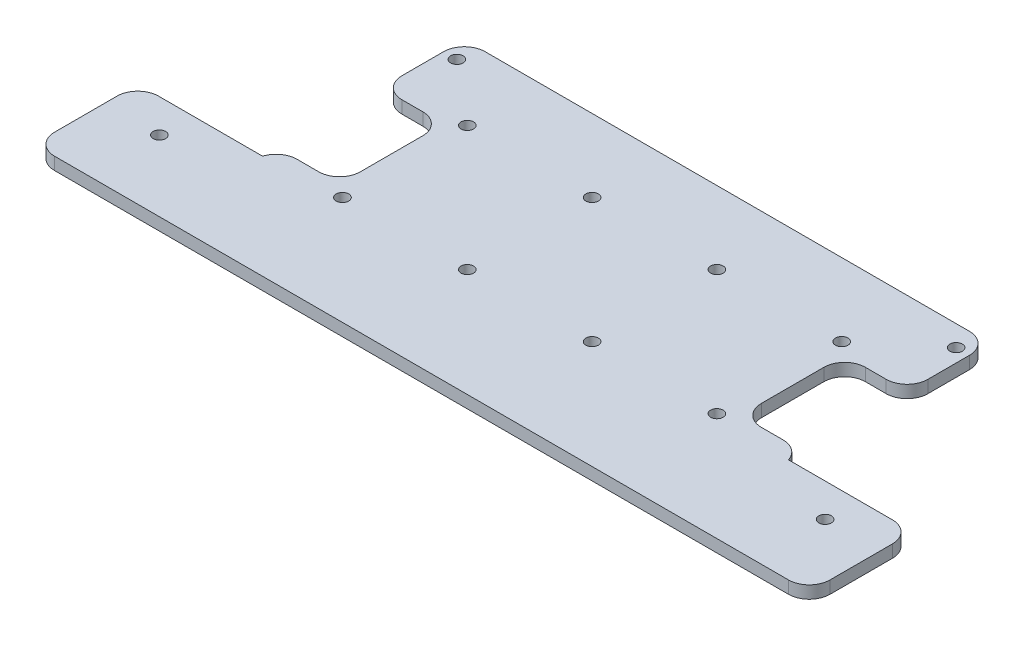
ISO-10303-21;
HEADER;
FILE_DESCRIPTION(('STEP AP214'),'2;1');
FILE_NAME('part.step','',(''),(''),'','','');
FILE_SCHEMA(('AUTOMOTIVE_DESIGN { 1 0 10303 214 1 1 1 1 }'));
ENDSEC;
DATA;
#1=APPLICATION_CONTEXT('core data for automotive mechanical design processes');
#2=APPLICATION_PROTOCOL_DEFINITION('international standard','automotive_design',2000,#1);
#3=PRODUCT_CONTEXT('',#1,'mechanical');
#4=PRODUCT('Part','Part','',(#3));
#5=PRODUCT_RELATED_PRODUCT_CATEGORY('part','',(#4));
#6=PRODUCT_DEFINITION_FORMATION('','',#4);
#7=PRODUCT_DEFINITION_CONTEXT('part definition',#1,'design');
#8=PRODUCT_DEFINITION('design','',#6,#7);
#9=PRODUCT_DEFINITION_SHAPE('','',#8);
#10=(LENGTH_UNIT() NAMED_UNIT(*) SI_UNIT(.MILLI.,.METRE.));
#11=(NAMED_UNIT(*) PLANE_ANGLE_UNIT() SI_UNIT($,.RADIAN.));
#12=(NAMED_UNIT(*) SI_UNIT($,.STERADIAN.) SOLID_ANGLE_UNIT());
#13=UNCERTAINTY_MEASURE_WITH_UNIT(LENGTH_MEASURE(1.E-05),#10,'distance_accuracy_value','');
#14=(GEOMETRIC_REPRESENTATION_CONTEXT(3) GLOBAL_UNCERTAINTY_ASSIGNED_CONTEXT((#13)) GLOBAL_UNIT_ASSIGNED_CONTEXT((#10,
#11,#12)) REPRESENTATION_CONTEXT('',''));
#15=CARTESIAN_POINT('',(0.,0.,0.));
#16=DIRECTION('',(0.,0.,1.));
#17=DIRECTION('',(1.,0.,0.));
#18=AXIS2_PLACEMENT_3D('',#15,#16,#17);
#19=CARTESIAN_POINT('',(63.2,0.,-36.75));
#20=DIRECTION('',(1.,0.,0.));
#21=DIRECTION('',(0.,0.,-1.));
#22=AXIS2_PLACEMENT_3D('',#19,#20,#21);
#23=PLANE('',#22);
#24=DIRECTION('',(0.,0.,-1.));
#25=VECTOR('',#24,1.);
#26=CARTESIAN_POINT('',(63.2,3.,-36.75));
#27=LINE('',#26,#25);
#28=CARTESIAN_POINT('',(63.2,3.,-21.75));
#29=VERTEX_POINT('',#28);
#30=CARTESIAN_POINT('',(63.2,3.,-31.75));
#31=VERTEX_POINT('',#30);
#32=EDGE_CURVE('E261',#29,#31,#27,.T.);
#33=ORIENTED_EDGE('',*,*,#32,.F.);
#34=DIRECTION('',(0.,1.,0.));
#35=VECTOR('',#34,1.);
#36=CARTESIAN_POINT('',(63.2,0.,-21.75));
#37=LINE('',#36,#35);
#38=CARTESIAN_POINT('',(63.2,0.,-21.75));
#39=VERTEX_POINT('',#38);
#40=EDGE_CURVE('E370',#29,#39,#37,.F.);
#41=ORIENTED_EDGE('',*,*,#40,.T.);
#42=DIRECTION('',(0.,0.,-1.));
#43=VECTOR('',#42,1.);
#44=CARTESIAN_POINT('',(63.2,0.,-36.75));
#45=LINE('',#44,#43);
#46=CARTESIAN_POINT('',(63.2,0.,-31.75));
#47=VERTEX_POINT('',#46);
#48=EDGE_CURVE('E247',#39,#47,#45,.T.);
#49=ORIENTED_EDGE('',*,*,#48,.T.);
#50=DIRECTION('',(0.,1.,0.));
#51=VECTOR('',#50,1.);
#52=CARTESIAN_POINT('',(63.2,3.,-31.75));
#53=LINE('',#52,#51);
#54=EDGE_CURVE('E367',#47,#31,#53,.T.);
#55=ORIENTED_EDGE('',*,*,#54,.T.);
#56=EDGE_LOOP('',(#33,#41,#49,#55));
#57=FACE_BOUND('',#56,.T.);
#58=ADVANCED_FACE('F36',(#57),#23,.T.);
#59=CARTESIAN_POINT('',(-63.2,0.,-36.75));
#60=DIRECTION('',(-1.,0.,0.));
#61=DIRECTION('',(0.,0.,1.));
#62=AXIS2_PLACEMENT_3D('',#59,#60,#61);
#63=PLANE('',#62);
#64=DIRECTION('',(0.,0.,1.));
#65=VECTOR('',#64,1.);
#66=CARTESIAN_POINT('',(-63.2,3.,-36.75));
#67=LINE('',#66,#65);
#68=CARTESIAN_POINT('',(-63.2,3.,-31.75));
#69=VERTEX_POINT('',#68);
#70=CARTESIAN_POINT('',(-63.2,3.,-21.75));
#71=VERTEX_POINT('',#70);
#72=EDGE_CURVE('E269',#69,#71,#67,.T.);
#73=ORIENTED_EDGE('',*,*,#72,.F.);
#74=DIRECTION('',(0.,1.,0.));
#75=VECTOR('',#74,1.);
#76=CARTESIAN_POINT('',(-63.2,0.,-31.75));
#77=LINE('',#76,#75);
#78=CARTESIAN_POINT('',(-63.2,0.,-31.75));
#79=VERTEX_POINT('',#78);
#80=EDGE_CURVE('E388',#69,#79,#77,.F.);
#81=ORIENTED_EDGE('',*,*,#80,.T.);
#82=DIRECTION('',(0.,0.,1.));
#83=VECTOR('',#82,1.);
#84=CARTESIAN_POINT('',(-63.2,0.,-36.75));
#85=LINE('',#84,#83);
#86=CARTESIAN_POINT('',(-63.2,0.,-21.75));
#87=VERTEX_POINT('',#86);
#88=EDGE_CURVE('E272',#79,#87,#85,.T.);
#89=ORIENTED_EDGE('',*,*,#88,.T.);
#90=DIRECTION('',(0.,-1.,0.));
#91=VECTOR('',#90,1.);
#92=CARTESIAN_POINT('',(-63.2,3.,-21.75));
#93=LINE('',#92,#91);
#94=EDGE_CURVE('E386',#87,#71,#93,.F.);
#95=ORIENTED_EDGE('',*,*,#94,.T.);
#96=EDGE_LOOP('',(#73,#81,#89,#95));
#97=FACE_BOUND('',#96,.T.);
#98=ADVANCED_FACE('F545',(#97),#63,.T.);
#99=CARTESIAN_POINT('',(-53.2,3.,-36.75));
#100=DIRECTION('',(0.,0.,1.));
#101=DIRECTION('',(1.,0.,0.));
#102=AXIS2_PLACEMENT_3D('',#99,#100,#101);
#103=PLANE('',#102);
#104=DIRECTION('',(-1.,0.,0.));
#105=VECTOR('',#104,1.);
#106=CARTESIAN_POINT('',(-53.2,3.,-36.75));
#107=LINE('',#106,#105);
#108=CARTESIAN_POINT('',(58.2,3.,-36.75));
#109=VERTEX_POINT('',#108);
#110=CARTESIAN_POINT('',(-58.2,3.,-36.75));
#111=VERTEX_POINT('',#110);
#112=EDGE_CURVE('E293',#109,#111,#107,.T.);
#113=ORIENTED_EDGE('',*,*,#112,.F.);
#114=DIRECTION('',(0.,1.,0.));
#115=VECTOR('',#114,1.);
#116=CARTESIAN_POINT('',(58.2,0.,-36.75));
#117=LINE('',#116,#115);
#118=CARTESIAN_POINT('',(58.2,0.,-36.75));
#119=VERTEX_POINT('',#118);
#120=EDGE_CURVE('E60',#109,#119,#117,.F.);
#121=ORIENTED_EDGE('',*,*,#120,.T.);
#122=DIRECTION('',(-1.,0.,0.));
#123=VECTOR('',#122,1.);
#124=CARTESIAN_POINT('',(-53.2,0.,-36.75));
#125=LINE('',#124,#123);
#126=CARTESIAN_POINT('',(-58.2,0.,-36.75));
#127=VERTEX_POINT('',#126);
#128=EDGE_CURVE('E292',#119,#127,#125,.T.);
#129=ORIENTED_EDGE('',*,*,#128,.T.);
#130=DIRECTION('',(0.,1.,0.));
#131=VECTOR('',#130,1.);
#132=CARTESIAN_POINT('',(-58.2,3.,-36.75));
#133=LINE('',#132,#131);
#134=EDGE_CURVE('E372',#127,#111,#133,.T.);
#135=ORIENTED_EDGE('',*,*,#134,.T.);
#136=EDGE_LOOP('',(#113,#121,#129,#135));
#137=FACE_BOUND('',#136,.T.);
#138=ADVANCED_FACE('F550',(#137),#103,.F.);
#139=CARTESIAN_POINT('',(-53.2,3.,36.75));
#140=DIRECTION('',(0.,0.,-1.));
#141=DIRECTION('',(-1.,0.,0.));
#142=AXIS2_PLACEMENT_3D('',#139,#140,#141);
#143=PLANE('',#142);
#144=DIRECTION('',(1.,0.,0.));
#145=VECTOR('',#144,1.);
#146=CARTESIAN_POINT('',(-53.2,0.,36.75));
#147=LINE('',#146,#145);
#148=CARTESIAN_POINT('',(-88.2,0.,36.75));
#149=VERTEX_POINT('',#148);
#150=CARTESIAN_POINT('',(88.2,0.,36.75));
#151=VERTEX_POINT('',#150);
#152=EDGE_CURVE('E297',#149,#151,#147,.T.);
#153=ORIENTED_EDGE('',*,*,#152,.T.);
#154=DIRECTION('',(0.,1.,0.));
#155=VECTOR('',#154,1.);
#156=CARTESIAN_POINT('',(88.2,3.,36.75));
#157=LINE('',#156,#155);
#158=CARTESIAN_POINT('',(88.2,3.,36.75));
#159=VERTEX_POINT('',#158);
#160=EDGE_CURVE('E383',#151,#159,#157,.T.);
#161=ORIENTED_EDGE('',*,*,#160,.T.);
#162=DIRECTION('',(1.,0.,0.));
#163=VECTOR('',#162,1.);
#164=CARTESIAN_POINT('',(-53.2,3.,36.75));
#165=LINE('',#164,#163);
#166=CARTESIAN_POINT('',(-88.2,3.,36.75));
#167=VERTEX_POINT('',#166);
#168=EDGE_CURVE('E296',#167,#159,#165,.T.);
#169=ORIENTED_EDGE('',*,*,#168,.F.);
#170=DIRECTION('',(0.,1.,0.));
#171=VECTOR('',#170,1.);
#172=CARTESIAN_POINT('',(-88.2,0.,36.75));
#173=LINE('',#172,#171);
#174=EDGE_CURVE('E381',#167,#149,#173,.F.);
#175=ORIENTED_EDGE('',*,*,#174,.T.);
#176=EDGE_LOOP('',(#153,#161,#169,#175));
#177=FACE_BOUND('',#176,.T.);
#178=ADVANCED_FACE('F581',(#177),#143,.F.);
#179=CARTESIAN_POINT('',(0.,3.,0.));
#180=DIRECTION('',(0.,1.,0.));
#181=DIRECTION('',(0.,0.,1.));
#182=AXIS2_PLACEMENT_3D('',#179,#180,#181);
#183=PLANE('',#182);
#184=CARTESIAN_POINT('',(-45.,3.,10.75));
#185=DIRECTION('',(0.,1.,0.));
#186=DIRECTION('',(0.,0.,-1.));
#187=AXIS2_PLACEMENT_3D('',#184,#185,#186);
#188=CIRCLE('',#187,1.5);
#189=CARTESIAN_POINT('',(-45.,3.,9.25000000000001));
#190=VERTEX_POINT('',#189);
#191=EDGE_CURVE('E984',#190,#190,#188,.T.);
#192=ORIENTED_EDGE('',*,*,#191,.F.);
#193=EDGE_LOOP('',(#192));
#194=FACE_BOUND('',#193,.T.);
#195=CARTESIAN_POINT('',(45.,3.,10.75));
#196=DIRECTION('',(0.,1.,0.));
#197=DIRECTION('',(0.,0.,1.));
#198=AXIS2_PLACEMENT_3D('',#195,#196,#197);
#199=CIRCLE('',#198,1.5);
#200=CARTESIAN_POINT('',(45.,3.,12.25));
#201=VERTEX_POINT('',#200);
#202=EDGE_CURVE('E985',#201,#201,#199,.T.);
#203=ORIENTED_EDGE('',*,*,#202,.F.);
#204=EDGE_LOOP('',(#203));
#205=FACE_BOUND('',#204,.T.);
#206=CARTESIAN_POINT('',(45.,3.,-19.25));
#207=DIRECTION('',(0.,1.,0.));
#208=DIRECTION('',(0.,0.,-1.));
#209=AXIS2_PLACEMENT_3D('',#206,#207,#208);
#210=CIRCLE('',#209,1.5);
#211=CARTESIAN_POINT('',(45.,3.,-20.75));
#212=VERTEX_POINT('',#211);
#213=EDGE_CURVE('E988',#212,#212,#210,.T.);
#214=ORIENTED_EDGE('',*,*,#213,.F.);
#215=EDGE_LOOP('',(#214));
#216=FACE_BOUND('',#215,.T.);
#217=CARTESIAN_POINT('',(-45.,3.,-19.25));
#218=DIRECTION('',(0.,1.,0.));
#219=DIRECTION('',(0.,0.,1.));
#220=AXIS2_PLACEMENT_3D('',#217,#218,#219);
#221=CIRCLE('',#220,1.5);
#222=CARTESIAN_POINT('',(-45.,3.,-17.75));
#223=VERTEX_POINT('',#222);
#224=EDGE_CURVE('E997',#223,#223,#221,.T.);
#225=ORIENTED_EDGE('',*,*,#224,.F.);
#226=EDGE_LOOP('',(#225));
#227=FACE_BOUND('',#226,.T.);
#228=CARTESIAN_POINT('',(-15.,3.,10.75));
#229=DIRECTION('',(0.,1.,0.));
#230=DIRECTION('',(0.,0.,-1.));
#231=AXIS2_PLACEMENT_3D('',#228,#229,#230);
#232=CIRCLE('',#231,1.5);
#233=CARTESIAN_POINT('',(-15.,3.,9.25000000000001));
#234=VERTEX_POINT('',#233);
#235=EDGE_CURVE('E452',#234,#234,#232,.T.);
#236=ORIENTED_EDGE('',*,*,#235,.F.);
#237=EDGE_LOOP('',(#236));
#238=FACE_BOUND('',#237,.T.);
#239=CARTESIAN_POINT('',(15.,3.,10.75));
#240=DIRECTION('',(0.,1.,0.));
#241=DIRECTION('',(0.,0.,1.));
#242=AXIS2_PLACEMENT_3D('',#239,#240,#241);
#243=CIRCLE('',#242,1.5);
#244=CARTESIAN_POINT('',(15.,3.,12.25));
#245=VERTEX_POINT('',#244);
#246=EDGE_CURVE('E993',#245,#245,#243,.T.);
#247=ORIENTED_EDGE('',*,*,#246,.F.);
#248=EDGE_LOOP('',(#247));
#249=FACE_BOUND('',#248,.T.);
#250=CARTESIAN_POINT('',(15.,3.,-19.25));
#251=DIRECTION('',(0.,1.,0.));
#252=DIRECTION('',(0.,0.,-1.));
#253=AXIS2_PLACEMENT_3D('',#250,#251,#252);
#254=CIRCLE('',#253,1.5);
#255=CARTESIAN_POINT('',(15.,3.,-20.75));
#256=VERTEX_POINT('',#255);
#257=EDGE_CURVE('E428',#256,#256,#254,.T.);
#258=ORIENTED_EDGE('',*,*,#257,.F.);
#259=EDGE_LOOP('',(#258));
#260=FACE_BOUND('',#259,.T.);
#261=CARTESIAN_POINT('',(-15.,3.,-19.25));
#262=DIRECTION('',(0.,1.,0.));
#263=DIRECTION('',(0.,0.,1.));
#264=AXIS2_PLACEMENT_3D('',#261,#262,#263);
#265=CIRCLE('',#264,1.5);
#266=CARTESIAN_POINT('',(-15.,3.,-17.75));
#267=VERTEX_POINT('',#266);
#268=EDGE_CURVE('E423',#267,#267,#265,.T.);
#269=ORIENTED_EDGE('',*,*,#268,.F.);
#270=EDGE_LOOP('',(#269));
#271=FACE_BOUND('',#270,.T.);
#272=DIRECTION('',(-1.,0.,0.));
#273=VECTOR('',#272,1.);
#274=CARTESIAN_POINT('',(-93.2,3.,11.75));
#275=LINE('',#274,#273);
#276=CARTESIAN_POINT('',(-63.2,3.,11.75));
#277=VERTEX_POINT('',#276);
#278=CARTESIAN_POINT('',(-88.2,3.,11.75));
#279=VERTEX_POINT('',#278);
#280=EDGE_CURVE('E285',#277,#279,#275,.T.);
#281=ORIENTED_EDGE('',*,*,#280,.T.);
#282=CARTESIAN_POINT('',(-88.2,3.,16.75));
#283=DIRECTION('',(0.,1.,0.));
#284=DIRECTION('',(0.,0.,1.));
#285=AXIS2_PLACEMENT_3D('',#282,#283,#284);
#286=CIRCLE('',#285,5.);
#287=CARTESIAN_POINT('',(-93.2,3.,16.75));
#288=VERTEX_POINT('',#287);
#289=EDGE_CURVE('E329',#279,#288,#286,.T.);
#290=ORIENTED_EDGE('',*,*,#289,.T.);
#291=DIRECTION('',(0.,0.,1.));
#292=VECTOR('',#291,1.);
#293=CARTESIAN_POINT('',(-93.2,3.,36.75));
#294=LINE('',#293,#292);
#295=CARTESIAN_POINT('',(-93.2,3.,31.75));
#296=VERTEX_POINT('',#295);
#297=EDGE_CURVE('E276',#288,#296,#294,.T.);
#298=ORIENTED_EDGE('',*,*,#297,.T.);
#299=CARTESIAN_POINT('',(-88.2,3.,31.75));
#300=DIRECTION('',(0.,1.,0.));
#301=DIRECTION('',(0.,0.,1.));
#302=AXIS2_PLACEMENT_3D('',#299,#300,#301);
#303=CIRCLE('',#302,5.);
#304=EDGE_CURVE('E318',#296,#167,#303,.T.);
#305=ORIENTED_EDGE('',*,*,#304,.T.);
#306=ORIENTED_EDGE('',*,*,#168,.T.);
#307=CARTESIAN_POINT('',(88.2,3.,31.75));
#308=DIRECTION('',(0.,1.,0.));
#309=DIRECTION('',(0.,0.,1.));
#310=AXIS2_PLACEMENT_3D('',#307,#308,#309);
#311=CIRCLE('',#310,5.);
#312=CARTESIAN_POINT('',(93.2,3.,31.75));
#313=VERTEX_POINT('',#312);
#314=EDGE_CURVE('E320',#159,#313,#311,.T.);
#315=ORIENTED_EDGE('',*,*,#314,.T.);
#316=DIRECTION('',(0.,0.,-1.));
#317=VECTOR('',#316,1.);
#318=CARTESIAN_POINT('',(93.2,3.,36.75));
#319=LINE('',#318,#317);
#320=CARTESIAN_POINT('',(93.2,3.,16.75));
#321=VERTEX_POINT('',#320);
#322=EDGE_CURVE('E491',#313,#321,#319,.T.);
#323=ORIENTED_EDGE('',*,*,#322,.T.);
#324=CARTESIAN_POINT('',(88.2,3.,16.75));
#325=DIRECTION('',(0.,1.,0.));
#326=DIRECTION('',(0.,0.,1.));
#327=AXIS2_PLACEMENT_3D('',#324,#325,#326);
#328=CIRCLE('',#327,5.);
#329=CARTESIAN_POINT('',(88.2,3.,11.75));
#330=VERTEX_POINT('',#329);
#331=EDGE_CURVE('E327',#321,#330,#328,.T.);
#332=ORIENTED_EDGE('',*,*,#331,.T.);
#333=DIRECTION('',(-1.,0.,0.));
#334=VECTOR('',#333,1.);
#335=CARTESIAN_POINT('',(93.2,3.,11.75));
#336=LINE('',#335,#334);
#337=CARTESIAN_POINT('',(63.2,3.,11.75));
#338=VERTEX_POINT('',#337);
#339=EDGE_CURVE('E497',#330,#338,#336,.T.);
#340=ORIENTED_EDGE('',*,*,#339,.T.);
#341=CARTESIAN_POINT('',(58.4303039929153,3.,13.25));
#342=DIRECTION('',(0.,1.,0.));
#343=DIRECTION('',(0.,0.,1.));
#344=AXIS2_PLACEMENT_3D('',#341,#342,#343);
#345=CIRCLE('',#344,5.);
#346=CARTESIAN_POINT('',(58.4303039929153,3.,8.25000000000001));
#347=VERTEX_POINT('',#346);
#348=EDGE_CURVE('E251',#338,#347,#345,.T.);
#349=ORIENTED_EDGE('',*,*,#348,.T.);
#350=DIRECTION('',(1.,0.,0.));
#351=VECTOR('',#350,1.);
#352=CARTESIAN_POINT('',(48.2,3.,8.25000000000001));
#353=LINE('',#352,#351);
#354=CARTESIAN_POINT('',(53.2,3.,8.25000000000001));
#355=VERTEX_POINT('',#354);
#356=EDGE_CURVE('E456',#355,#347,#353,.T.);
#357=ORIENTED_EDGE('',*,*,#356,.F.);
#358=CARTESIAN_POINT('',(53.2,3.,3.25000000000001));
#359=DIRECTION('',(0.,1.,0.));
#360=DIRECTION('',(0.,0.,1.));
#361=AXIS2_PLACEMENT_3D('',#358,#359,#360);
#362=CIRCLE('',#361,5.);
#363=CARTESIAN_POINT('',(48.2,3.,3.25000000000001));
#364=VERTEX_POINT('',#363);
#365=EDGE_CURVE('E410',#355,#364,#362,.F.);
#366=ORIENTED_EDGE('',*,*,#365,.T.);
#367=DIRECTION('',(0.,0.,1.));
#368=VECTOR('',#367,1.);
#369=CARTESIAN_POINT('',(48.2,3.,-16.75));
#370=LINE('',#369,#368);
#371=CARTESIAN_POINT('',(48.2,3.,-11.75));
#372=VERTEX_POINT('',#371);
#373=EDGE_CURVE('E422',#372,#364,#370,.T.);
#374=ORIENTED_EDGE('',*,*,#373,.F.);
#375=CARTESIAN_POINT('',(53.2,3.,-11.75));
#376=DIRECTION('',(0.,1.,0.));
#377=DIRECTION('',(0.,0.,1.));
#378=AXIS2_PLACEMENT_3D('',#375,#376,#377);
#379=CIRCLE('',#378,5.);
#380=CARTESIAN_POINT('',(53.2,3.,-16.75));
#381=VERTEX_POINT('',#380);
#382=EDGE_CURVE('E406',#372,#381,#379,.F.);
#383=ORIENTED_EDGE('',*,*,#382,.T.);
#384=DIRECTION('',(-1.,0.,0.));
#385=VECTOR('',#384,1.);
#386=CARTESIAN_POINT('',(48.2,3.,-16.75));
#387=LINE('',#386,#385);
#388=CARTESIAN_POINT('',(58.2,3.,-16.75));
#389=VERTEX_POINT('',#388);
#390=EDGE_CURVE('E459',#389,#381,#387,.T.);
#391=ORIENTED_EDGE('',*,*,#390,.F.);
#392=CARTESIAN_POINT('',(58.2,3.,-21.75));
#393=DIRECTION('',(0.,1.,0.));
#394=DIRECTION('',(0.,0.,1.));
#395=AXIS2_PLACEMENT_3D('',#392,#393,#394);
#396=CIRCLE('',#395,5.);
#397=EDGE_CURVE('E325',#389,#29,#396,.T.);
#398=ORIENTED_EDGE('',*,*,#397,.T.);
#399=ORIENTED_EDGE('',*,*,#32,.T.);
#400=CARTESIAN_POINT('',(58.2,3.,-31.75));
#401=DIRECTION('',(0.,1.,0.));
#402=DIRECTION('',(0.,0.,1.));
#403=AXIS2_PLACEMENT_3D('',#400,#401,#402);
#404=CIRCLE('',#403,5.);
#405=EDGE_CURVE('E323',#31,#109,#404,.T.);
#406=ORIENTED_EDGE('',*,*,#405,.T.);
#407=ORIENTED_EDGE('',*,*,#112,.T.);
#408=CARTESIAN_POINT('',(-58.2,3.,-31.75));
#409=DIRECTION('',(0.,1.,0.));
#410=DIRECTION('',(0.,0.,1.));
#411=AXIS2_PLACEMENT_3D('',#408,#409,#410);
#412=CIRCLE('',#411,5.);
#413=EDGE_CURVE('E316',#111,#69,#412,.T.);
#414=ORIENTED_EDGE('',*,*,#413,.T.);
#415=ORIENTED_EDGE('',*,*,#72,.T.);
#416=CARTESIAN_POINT('',(-58.2,3.,-21.75));
#417=DIRECTION('',(0.,1.,0.));
#418=DIRECTION('',(0.,0.,1.));
#419=AXIS2_PLACEMENT_3D('',#416,#417,#418);
#420=CIRCLE('',#419,5.);
#421=CARTESIAN_POINT('',(-58.2,3.,-16.75));
#422=VERTEX_POINT('',#421);
#423=EDGE_CURVE('E314',#71,#422,#420,.T.);
#424=ORIENTED_EDGE('',*,*,#423,.T.);
#425=DIRECTION('',(-1.,0.,0.));
#426=VECTOR('',#425,1.);
#427=CARTESIAN_POINT('',(-48.2,3.,-16.75));
#428=LINE('',#427,#426);
#429=CARTESIAN_POINT('',(-53.2,3.,-16.75));
#430=VERTEX_POINT('',#429);
#431=EDGE_CURVE('E472',#430,#422,#428,.T.);
#432=ORIENTED_EDGE('',*,*,#431,.F.);
#433=CARTESIAN_POINT('',(-53.2,3.,-11.75));
#434=DIRECTION('',(0.,1.,0.));
#435=DIRECTION('',(0.,0.,1.));
#436=AXIS2_PLACEMENT_3D('',#433,#434,#435);
#437=CIRCLE('',#436,5.);
#438=CARTESIAN_POINT('',(-48.2,3.,-11.75));
#439=VERTEX_POINT('',#438);
#440=EDGE_CURVE('E45',#430,#439,#437,.F.);
#441=ORIENTED_EDGE('',*,*,#440,.T.);
#442=DIRECTION('',(0.,0.,-1.));
#443=VECTOR('',#442,1.);
#444=CARTESIAN_POINT('',(-48.2,3.,-16.75));
#445=LINE('',#444,#443);
#446=CARTESIAN_POINT('',(-48.2,3.,3.25000000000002));
#447=VERTEX_POINT('',#446);
#448=EDGE_CURVE('E469',#447,#439,#445,.T.);
#449=ORIENTED_EDGE('',*,*,#448,.F.);
#450=CARTESIAN_POINT('',(-53.2,3.,3.25000000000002));
#451=DIRECTION('',(0.,1.,0.));
#452=DIRECTION('',(0.,0.,1.));
#453=AXIS2_PLACEMENT_3D('',#450,#451,#452);
#454=CIRCLE('',#453,5.);
#455=CARTESIAN_POINT('',(-53.2,3.,8.25000000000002));
#456=VERTEX_POINT('',#455);
#457=EDGE_CURVE('E414',#447,#456,#454,.F.);
#458=ORIENTED_EDGE('',*,*,#457,.T.);
#459=DIRECTION('',(1.,0.,0.));
#460=VECTOR('',#459,1.);
#461=CARTESIAN_POINT('',(-48.2,3.,8.25000000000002));
#462=LINE('',#461,#460);
#463=CARTESIAN_POINT('',(-58.4303039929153,3.,8.25000000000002));
#464=VERTEX_POINT('',#463);
#465=EDGE_CURVE('E466',#464,#456,#462,.T.);
#466=ORIENTED_EDGE('',*,*,#465,.F.);
#467=CARTESIAN_POINT('',(-58.4303039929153,3.,13.25));
#468=DIRECTION('',(0.,1.,0.));
#469=DIRECTION('',(0.,0.,1.));
#470=AXIS2_PLACEMENT_3D('',#467,#468,#469);
#471=CIRCLE('',#470,5.);
#472=EDGE_CURVE('E312',#464,#277,#471,.T.);
#473=ORIENTED_EDGE('',*,*,#472,.T.);
#474=EDGE_LOOP('',(#281,#290,#298,#305,#306,#315,#323,#332,#340,#349,#357,#366,#374,#383,#391,
#398,#399,#406,#407,#414,#415,#424,#432,#441,#449,#458,#466,#473));
#475=FACE_BOUND('',#474,.T.);
#476=CARTESIAN_POINT('',(-80.,3.,19.75));
#477=DIRECTION('',(0.,1.,0.));
#478=DIRECTION('',(0.,0.,1.));
#479=AXIS2_PLACEMENT_3D('',#476,#477,#478);
#480=CIRCLE('',#479,1.5);
#481=CARTESIAN_POINT('',(-80.,3.,21.25));
#482=VERTEX_POINT('',#481);
#483=EDGE_CURVE('E252',#482,#482,#480,.T.);
#484=ORIENTED_EDGE('',*,*,#483,.F.);
#485=EDGE_LOOP('',(#484));
#486=FACE_BOUND('',#485,.T.);
#487=CARTESIAN_POINT('',(-60.,3.,-31.75));
#488=DIRECTION('',(0.,1.,0.));
#489=DIRECTION('',(0.,0.,1.));
#490=AXIS2_PLACEMENT_3D('',#487,#488,#489);
#491=CIRCLE('',#490,1.5);
#492=CARTESIAN_POINT('',(-60.,3.,-30.25));
#493=VERTEX_POINT('',#492);
#494=EDGE_CURVE('E264',#493,#493,#491,.T.);
#495=ORIENTED_EDGE('',*,*,#494,.F.);
#496=EDGE_LOOP('',(#495));
#497=FACE_BOUND('',#496,.T.);
#498=CARTESIAN_POINT('',(60.,3.,-31.75));
#499=DIRECTION('',(0.,1.,0.));
#500=DIRECTION('',(0.,0.,-1.));
#501=AXIS2_PLACEMENT_3D('',#498,#499,#500);
#502=CIRCLE('',#501,1.50000000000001);
#503=CARTESIAN_POINT('',(60.,3.,-33.25));
#504=VERTEX_POINT('',#503);
#505=EDGE_CURVE('E481',#504,#504,#502,.T.);
#506=ORIENTED_EDGE('',*,*,#505,.F.);
#507=EDGE_LOOP('',(#506));
#508=FACE_BOUND('',#507,.T.);
#509=CARTESIAN_POINT('',(80.,3.,19.75));
#510=DIRECTION('',(0.,1.,0.));
#511=DIRECTION('',(0.,0.,-1.));
#512=AXIS2_PLACEMENT_3D('',#509,#510,#511);
#513=CIRCLE('',#512,1.5);
#514=CARTESIAN_POINT('',(80.,3.,18.25));
#515=VERTEX_POINT('',#514);
#516=EDGE_CURVE('E485',#515,#515,#513,.T.);
#517=ORIENTED_EDGE('',*,*,#516,.F.);
#518=EDGE_LOOP('',(#517));
#519=FACE_BOUND('',#518,.T.);
#520=ADVANCED_FACE('F501',(#194,#205,#216,#227,#238,#249,#260,#271,#475,#486,#497,#508,#519),
#183,.T.);
#521=CARTESIAN_POINT('',(0.,0.,0.));
#522=DIRECTION('',(0.,1.,0.));
#523=DIRECTION('',(0.,0.,1.));
#524=AXIS2_PLACEMENT_3D('',#521,#522,#523);
#525=PLANE('',#524);
#526=CARTESIAN_POINT('',(-45.,0.,10.75));
#527=DIRECTION('',(0.,1.,0.));
#528=DIRECTION('',(0.,0.,1.));
#529=AXIS2_PLACEMENT_3D('',#526,#527,#528);
#530=CIRCLE('',#529,1.5);
#531=CARTESIAN_POINT('',(-45.,0.,12.25));
#532=VERTEX_POINT('',#531);
#533=EDGE_CURVE('E40',#532,#532,#530,.T.);
#534=ORIENTED_EDGE('',*,*,#533,.T.);
#535=EDGE_LOOP('',(#534));
#536=FACE_BOUND('',#535,.T.);
#537=CARTESIAN_POINT('',(45.,0.,10.75));
#538=DIRECTION('',(0.,1.,0.));
#539=DIRECTION('',(0.,0.,1.));
#540=AXIS2_PLACEMENT_3D('',#537,#538,#539);
#541=CIRCLE('',#540,1.5);
#542=CARTESIAN_POINT('',(45.,0.,12.25));
#543=VERTEX_POINT('',#542);
#544=EDGE_CURVE('E439',#543,#543,#541,.T.);
#545=ORIENTED_EDGE('',*,*,#544,.T.);
#546=EDGE_LOOP('',(#545));
#547=FACE_BOUND('',#546,.T.);
#548=CARTESIAN_POINT('',(45.,0.,-19.25));
#549=DIRECTION('',(0.,1.,0.));
#550=DIRECTION('',(0.,0.,1.));
#551=AXIS2_PLACEMENT_3D('',#548,#549,#550);
#552=CIRCLE('',#551,1.5);
#553=CARTESIAN_POINT('',(45.,0.,-17.75));
#554=VERTEX_POINT('',#553);
#555=EDGE_CURVE('E437',#554,#554,#552,.T.);
#556=ORIENTED_EDGE('',*,*,#555,.T.);
#557=EDGE_LOOP('',(#556));
#558=FACE_BOUND('',#557,.T.);
#559=CARTESIAN_POINT('',(-45.,0.,-19.25));
#560=DIRECTION('',(0.,1.,0.));
#561=DIRECTION('',(0.,0.,1.));
#562=AXIS2_PLACEMENT_3D('',#559,#560,#561);
#563=CIRCLE('',#562,1.5);
#564=CARTESIAN_POINT('',(-45.,0.,-17.75));
#565=VERTEX_POINT('',#564);
#566=EDGE_CURVE('E434',#565,#565,#563,.T.);
#567=ORIENTED_EDGE('',*,*,#566,.T.);
#568=EDGE_LOOP('',(#567));
#569=FACE_BOUND('',#568,.T.);
#570=CARTESIAN_POINT('',(-15.,0.,10.75));
#571=DIRECTION('',(0.,1.,0.));
#572=DIRECTION('',(0.,0.,1.));
#573=AXIS2_PLACEMENT_3D('',#570,#571,#572);
#574=CIRCLE('',#573,1.5);
#575=CARTESIAN_POINT('',(-15.,0.,12.25));
#576=VERTEX_POINT('',#575);
#577=EDGE_CURVE('E431',#576,#576,#574,.T.);
#578=ORIENTED_EDGE('',*,*,#577,.T.);
#579=EDGE_LOOP('',(#578));
#580=FACE_BOUND('',#579,.T.);
#581=CARTESIAN_POINT('',(15.,0.,10.75));
#582=DIRECTION('',(0.,1.,0.));
#583=DIRECTION('',(0.,0.,1.));
#584=AXIS2_PLACEMENT_3D('',#581,#582,#583);
#585=CIRCLE('',#584,1.5);
#586=CARTESIAN_POINT('',(15.,0.,12.25));
#587=VERTEX_POINT('',#586);
#588=EDGE_CURVE('E427',#587,#587,#585,.T.);
#589=ORIENTED_EDGE('',*,*,#588,.T.);
#590=EDGE_LOOP('',(#589));
#591=FACE_BOUND('',#590,.T.);
#592=CARTESIAN_POINT('',(15.,0.,-19.25));
#593=DIRECTION('',(0.,1.,0.));
#594=DIRECTION('',(0.,0.,1.));
#595=AXIS2_PLACEMENT_3D('',#592,#593,#594);
#596=CIRCLE('',#595,1.5);
#597=CARTESIAN_POINT('',(15.,0.,-17.75));
#598=VERTEX_POINT('',#597);
#599=EDGE_CURVE('E424',#598,#598,#596,.T.);
#600=ORIENTED_EDGE('',*,*,#599,.T.);
#601=EDGE_LOOP('',(#600));
#602=FACE_BOUND('',#601,.T.);
#603=CARTESIAN_POINT('',(-15.,0.,-19.25));
#604=DIRECTION('',(0.,1.,0.));
#605=DIRECTION('',(0.,0.,1.));
#606=AXIS2_PLACEMENT_3D('',#603,#604,#605);
#607=CIRCLE('',#606,1.5);
#608=CARTESIAN_POINT('',(-15.,0.,-17.75));
#609=VERTEX_POINT('',#608);
#610=EDGE_CURVE('E419',#609,#609,#607,.T.);
#611=ORIENTED_EDGE('',*,*,#610,.T.);
#612=EDGE_LOOP('',(#611));
#613=FACE_BOUND('',#612,.T.);
#614=DIRECTION('',(0.,0.,1.));
#615=VECTOR('',#614,1.);
#616=CARTESIAN_POINT('',(-93.2,0.,36.75));
#617=LINE('',#616,#615);
#618=CARTESIAN_POINT('',(-93.2,0.,16.75));
#619=VERTEX_POINT('',#618);
#620=CARTESIAN_POINT('',(-93.2,0.,31.75));
#621=VERTEX_POINT('',#620);
#622=EDGE_CURVE('E279',#619,#621,#617,.T.);
#623=ORIENTED_EDGE('',*,*,#622,.F.);
#624=CARTESIAN_POINT('',(-88.2,0.,16.75));
#625=DIRECTION('',(0.,1.,0.));
#626=DIRECTION('',(0.,0.,1.));
#627=AXIS2_PLACEMENT_3D('',#624,#625,#626);
#628=CIRCLE('',#627,5.);
#629=CARTESIAN_POINT('',(-88.2,0.,11.75));
#630=VERTEX_POINT('',#629);
#631=EDGE_CURVE('E349',#619,#630,#628,.F.);
#632=ORIENTED_EDGE('',*,*,#631,.T.);
#633=DIRECTION('',(-1.,0.,0.));
#634=VECTOR('',#633,1.);
#635=CARTESIAN_POINT('',(-93.2,0.,11.75));
#636=LINE('',#635,#634);
#637=CARTESIAN_POINT('',(-63.2,0.,11.75));
#638=VERTEX_POINT('',#637);
#639=EDGE_CURVE('E275',#638,#630,#636,.T.);
#640=ORIENTED_EDGE('',*,*,#639,.F.);
#641=CARTESIAN_POINT('',(-58.4303039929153,0.,13.25));
#642=DIRECTION('',(0.,1.,0.));
#643=DIRECTION('',(0.,0.,1.));
#644=AXIS2_PLACEMENT_3D('',#641,#642,#643);
#645=CIRCLE('',#644,5.);
#646=CARTESIAN_POINT('',(-58.4303039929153,0.,8.25000000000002));
#647=VERTEX_POINT('',#646);
#648=EDGE_CURVE('E336',#638,#647,#645,.F.);
#649=ORIENTED_EDGE('',*,*,#648,.T.);
#650=DIRECTION('',(1.,0.,0.));
#651=VECTOR('',#650,1.);
#652=CARTESIAN_POINT('',(0.,0.,8.25000000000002));
#653=LINE('',#652,#651);
#654=CARTESIAN_POINT('',(-53.2,0.,8.25000000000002));
#655=VERTEX_POINT('',#654);
#656=EDGE_CURVE('E475',#647,#655,#653,.T.);
#657=ORIENTED_EDGE('',*,*,#656,.T.);
#658=CARTESIAN_POINT('',(-53.2,0.,3.25000000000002));
#659=DIRECTION('',(0.,1.,0.));
#660=DIRECTION('',(0.,0.,1.));
#661=AXIS2_PLACEMENT_3D('',#658,#659,#660);
#662=CIRCLE('',#661,5.);
#663=CARTESIAN_POINT('',(-48.2,0.,3.25000000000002));
#664=VERTEX_POINT('',#663);
#665=EDGE_CURVE('E416',#655,#664,#662,.T.);
#666=ORIENTED_EDGE('',*,*,#665,.T.);
#667=DIRECTION('',(0.,0.,-1.));
#668=VECTOR('',#667,1.);
#669=CARTESIAN_POINT('',(-48.2,0.,0.));
#670=LINE('',#669,#668);
#671=CARTESIAN_POINT('',(-48.2,0.,-11.75));
#672=VERTEX_POINT('',#671);
#673=EDGE_CURVE('E300',#664,#672,#670,.T.);
#674=ORIENTED_EDGE('',*,*,#673,.T.);
#675=CARTESIAN_POINT('',(-53.2,0.,-11.75));
#676=DIRECTION('',(0.,1.,0.));
#677=DIRECTION('',(0.,0.,1.));
#678=AXIS2_PLACEMENT_3D('',#675,#676,#677);
#679=CIRCLE('',#678,5.);
#680=CARTESIAN_POINT('',(-53.2,0.,-16.75));
#681=VERTEX_POINT('',#680);
#682=EDGE_CURVE('E11',#672,#681,#679,.T.);
#683=ORIENTED_EDGE('',*,*,#682,.T.);
#684=DIRECTION('',(-1.,0.,0.));
#685=VECTOR('',#684,1.);
#686=CARTESIAN_POINT('',(0.,0.,-16.75));
#687=LINE('',#686,#685);
#688=CARTESIAN_POINT('',(-58.2,0.,-16.75));
#689=VERTEX_POINT('',#688);
#690=EDGE_CURVE('E478',#681,#689,#687,.T.);
#691=ORIENTED_EDGE('',*,*,#690,.T.);
#692=CARTESIAN_POINT('',(-58.2,0.,-21.75));
#693=DIRECTION('',(0.,1.,0.));
#694=DIRECTION('',(0.,0.,1.));
#695=AXIS2_PLACEMENT_3D('',#692,#693,#694);
#696=CIRCLE('',#695,5.);
#697=EDGE_CURVE('E338',#689,#87,#696,.F.);
#698=ORIENTED_EDGE('',*,*,#697,.T.);
#699=ORIENTED_EDGE('',*,*,#88,.F.);
#700=CARTESIAN_POINT('',(-58.2,0.,-31.75));
#701=DIRECTION('',(0.,1.,0.));
#702=DIRECTION('',(0.,0.,1.));
#703=AXIS2_PLACEMENT_3D('',#700,#701,#702);
#704=CIRCLE('',#703,5.);
#705=EDGE_CURVE('E53',#79,#127,#704,.F.);
#706=ORIENTED_EDGE('',*,*,#705,.T.);
#707=ORIENTED_EDGE('',*,*,#128,.F.);
#708=CARTESIAN_POINT('',(58.2,0.,-31.75));
#709=DIRECTION('',(0.,1.,0.));
#710=DIRECTION('',(0.,0.,1.));
#711=AXIS2_PLACEMENT_3D('',#708,#709,#710);
#712=CIRCLE('',#711,5.);
#713=EDGE_CURVE('E236',#119,#47,#712,.F.);
#714=ORIENTED_EDGE('',*,*,#713,.T.);
#715=ORIENTED_EDGE('',*,*,#48,.F.);
#716=CARTESIAN_POINT('',(58.2,0.,-21.75));
#717=DIRECTION('',(0.,1.,0.));
#718=DIRECTION('',(0.,0.,1.));
#719=AXIS2_PLACEMENT_3D('',#716,#717,#718);
#720=CIRCLE('',#719,5.);
#721=CARTESIAN_POINT('',(58.2,0.,-16.75));
#722=VERTEX_POINT('',#721);
#723=EDGE_CURVE('E345',#39,#722,#720,.F.);
#724=ORIENTED_EDGE('',*,*,#723,.T.);
#725=DIRECTION('',(-1.,0.,0.));
#726=VECTOR('',#725,1.);
#727=CARTESIAN_POINT('',(0.,0.,-16.75));
#728=LINE('',#727,#726);
#729=CARTESIAN_POINT('',(53.2,0.,-16.75));
#730=VERTEX_POINT('',#729);
#731=EDGE_CURVE('E463',#722,#730,#728,.T.);
#732=ORIENTED_EDGE('',*,*,#731,.T.);
#733=CARTESIAN_POINT('',(53.2,0.,-11.75));
#734=DIRECTION('',(0.,1.,0.));
#735=DIRECTION('',(0.,0.,1.));
#736=AXIS2_PLACEMENT_3D('',#733,#734,#735);
#737=CIRCLE('',#736,5.);
#738=CARTESIAN_POINT('',(48.2,0.,-11.75));
#739=VERTEX_POINT('',#738);
#740=EDGE_CURVE('E408',#730,#739,#737,.T.);
#741=ORIENTED_EDGE('',*,*,#740,.T.);
#742=DIRECTION('',(0.,0.,1.));
#743=VECTOR('',#742,1.);
#744=CARTESIAN_POINT('',(48.2,0.,0.));
#745=LINE('',#744,#743);
#746=CARTESIAN_POINT('',(48.2,0.,3.25000000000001));
#747=VERTEX_POINT('',#746);
#748=EDGE_CURVE('E306',#739,#747,#745,.T.);
#749=ORIENTED_EDGE('',*,*,#748,.T.);
#750=CARTESIAN_POINT('',(53.2,0.,3.25000000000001));
#751=DIRECTION('',(0.,1.,0.));
#752=DIRECTION('',(0.,0.,1.));
#753=AXIS2_PLACEMENT_3D('',#750,#751,#752);
#754=CIRCLE('',#753,5.);
#755=CARTESIAN_POINT('',(53.2,0.,8.25000000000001));
#756=VERTEX_POINT('',#755);
#757=EDGE_CURVE('E412',#747,#756,#754,.T.);
#758=ORIENTED_EDGE('',*,*,#757,.T.);
#759=DIRECTION('',(1.,0.,0.));
#760=VECTOR('',#759,1.);
#761=CARTESIAN_POINT('',(0.,0.,8.25000000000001));
#762=LINE('',#761,#760);
#763=CARTESIAN_POINT('',(58.4303039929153,0.,8.25000000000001));
#764=VERTEX_POINT('',#763);
#765=EDGE_CURVE('E231',#756,#764,#762,.T.);
#766=ORIENTED_EDGE('',*,*,#765,.T.);
#767=CARTESIAN_POINT('',(58.4303039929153,0.,13.25));
#768=DIRECTION('',(0.,1.,0.));
#769=DIRECTION('',(0.,0.,1.));
#770=AXIS2_PLACEMENT_3D('',#767,#768,#769);
#771=CIRCLE('',#770,5.);
#772=CARTESIAN_POINT('',(63.2,0.,11.75));
#773=VERTEX_POINT('',#772);
#774=EDGE_CURVE('E223',#764,#773,#771,.F.);
#775=ORIENTED_EDGE('',*,*,#774,.T.);
#776=DIRECTION('',(-1.,0.,0.));
#777=VECTOR('',#776,1.);
#778=CARTESIAN_POINT('',(93.2,0.,11.75));
#779=LINE('',#778,#777);
#780=CARTESIAN_POINT('',(88.2,0.,11.75));
#781=VERTEX_POINT('',#780);
#782=EDGE_CURVE('E228',#781,#773,#779,.T.);
#783=ORIENTED_EDGE('',*,*,#782,.F.);
#784=CARTESIAN_POINT('',(88.2,0.,16.75));
#785=DIRECTION('',(0.,1.,0.));
#786=DIRECTION('',(0.,0.,1.));
#787=AXIS2_PLACEMENT_3D('',#784,#785,#786);
#788=CIRCLE('',#787,5.);
#789=CARTESIAN_POINT('',(93.2,0.,16.75));
#790=VERTEX_POINT('',#789);
#791=EDGE_CURVE('E347',#781,#790,#788,.F.);
#792=ORIENTED_EDGE('',*,*,#791,.T.);
#793=DIRECTION('',(0.,0.,-1.));
#794=VECTOR('',#793,1.);
#795=CARTESIAN_POINT('',(93.2,0.,36.75));
#796=LINE('',#795,#794);
#797=CARTESIAN_POINT('',(93.2,0.,31.75));
#798=VERTEX_POINT('',#797);
#799=EDGE_CURVE('E248',#798,#790,#796,.T.);
#800=ORIENTED_EDGE('',*,*,#799,.F.);
#801=CARTESIAN_POINT('',(88.2,0.,31.75));
#802=DIRECTION('',(0.,1.,0.));
#803=DIRECTION('',(0.,0.,1.));
#804=AXIS2_PLACEMENT_3D('',#801,#802,#803);
#805=CIRCLE('',#804,5.);
#806=EDGE_CURVE('E237',#798,#151,#805,.F.);
#807=ORIENTED_EDGE('',*,*,#806,.T.);
#808=ORIENTED_EDGE('',*,*,#152,.F.);
#809=CARTESIAN_POINT('',(-88.2,0.,31.75));
#810=DIRECTION('',(0.,1.,0.));
#811=DIRECTION('',(0.,0.,1.));
#812=AXIS2_PLACEMENT_3D('',#809,#810,#811);
#813=CIRCLE('',#812,5.);
#814=EDGE_CURVE('E341',#149,#621,#813,.F.);
#815=ORIENTED_EDGE('',*,*,#814,.T.);
#816=EDGE_LOOP('',(#623,#632,#640,#649,#657,#666,#674,#683,#691,#698,#699,#706,#707,#714,#715,
#724,#732,#741,#749,#758,#766,#775,#783,#792,#800,#807,#808,#815));
#817=FACE_BOUND('',#816,.T.);
#818=CARTESIAN_POINT('',(-80.,0.,19.75));
#819=DIRECTION('',(0.,1.,0.));
#820=DIRECTION('',(0.,0.,1.));
#821=AXIS2_PLACEMENT_3D('',#818,#819,#820);
#822=CIRCLE('',#821,1.5);
#823=CARTESIAN_POINT('',(-80.,0.,21.25));
#824=VERTEX_POINT('',#823);
#825=EDGE_CURVE('E255',#824,#824,#822,.T.);
#826=ORIENTED_EDGE('',*,*,#825,.T.);
#827=EDGE_LOOP('',(#826));
#828=FACE_BOUND('',#827,.T.);
#829=CARTESIAN_POINT('',(-60.,0.,-31.75));
#830=DIRECTION('',(0.,1.,0.));
#831=DIRECTION('',(0.,0.,1.));
#832=AXIS2_PLACEMENT_3D('',#829,#830,#831);
#833=CIRCLE('',#832,1.5);
#834=CARTESIAN_POINT('',(-60.,0.,-30.25));
#835=VERTEX_POINT('',#834);
#836=EDGE_CURVE('E266',#835,#835,#833,.T.);
#837=ORIENTED_EDGE('',*,*,#836,.T.);
#838=EDGE_LOOP('',(#837));
#839=FACE_BOUND('',#838,.T.);
#840=CARTESIAN_POINT('',(60.,0.,-31.75));
#841=DIRECTION('',(0.,1.,0.));
#842=DIRECTION('',(0.,0.,-1.));
#843=AXIS2_PLACEMENT_3D('',#840,#841,#842);
#844=CIRCLE('',#843,1.50000000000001);
#845=CARTESIAN_POINT('',(60.,0.,-33.25));
#846=VERTEX_POINT('',#845);
#847=EDGE_CURVE('E482',#846,#846,#844,.T.);
#848=ORIENTED_EDGE('',*,*,#847,.T.);
#849=EDGE_LOOP('',(#848));
#850=FACE_BOUND('',#849,.T.);
#851=CARTESIAN_POINT('',(80.,0.,19.75));
#852=DIRECTION('',(0.,1.,0.));
#853=DIRECTION('',(0.,0.,-1.));
#854=AXIS2_PLACEMENT_3D('',#851,#852,#853);
#855=CIRCLE('',#854,1.5);
#856=CARTESIAN_POINT('',(80.,0.,18.25));
#857=VERTEX_POINT('',#856);
#858=EDGE_CURVE('E488',#857,#857,#855,.T.);
#859=ORIENTED_EDGE('',*,*,#858,.T.);
#860=EDGE_LOOP('',(#859));
#861=FACE_BOUND('',#860,.T.);
#862=ADVANCED_FACE('F226',(#536,#547,#558,#569,#580,#591,#602,#613,#817,#828,#839,#850,#861),
#525,.F.);
#863=CARTESIAN_POINT('',(-93.2,0.,36.75));
#864=DIRECTION('',(-1.,0.,0.));
#865=DIRECTION('',(0.,0.,1.));
#866=AXIS2_PLACEMENT_3D('',#863,#864,#865);
#867=PLANE('',#866);
#868=ORIENTED_EDGE('',*,*,#297,.F.);
#869=DIRECTION('',(0.,1.,0.));
#870=VECTOR('',#869,1.);
#871=CARTESIAN_POINT('',(-93.2,0.,16.75));
#872=LINE('',#871,#870);
#873=EDGE_CURVE('E334',#288,#619,#872,.F.);
#874=ORIENTED_EDGE('',*,*,#873,.T.);
#875=ORIENTED_EDGE('',*,*,#622,.T.);
#876=DIRECTION('',(0.,1.,0.));
#877=VECTOR('',#876,1.);
#878=CARTESIAN_POINT('',(-93.2,3.,31.75));
#879=LINE('',#878,#877);
#880=EDGE_CURVE('E331',#621,#296,#879,.T.);
#881=ORIENTED_EDGE('',*,*,#880,.T.);
#882=EDGE_LOOP('',(#868,#874,#875,#881));
#883=FACE_BOUND('',#882,.T.);
#884=ADVANCED_FACE('F572',(#883),#867,.T.);
#885=CARTESIAN_POINT('',(-93.2,0.,11.75));
#886=DIRECTION('',(0.,0.,-1.));
#887=DIRECTION('',(-1.,0.,0.));
#888=AXIS2_PLACEMENT_3D('',#885,#886,#887);
#889=PLANE('',#888);
#890=ORIENTED_EDGE('',*,*,#639,.T.);
#891=DIRECTION('',(0.,1.,0.));
#892=VECTOR('',#891,1.);
#893=CARTESIAN_POINT('',(-88.2,0.,11.75));
#894=LINE('',#893,#892);
#895=EDGE_CURVE('E309',#630,#279,#894,.T.);
#896=ORIENTED_EDGE('',*,*,#895,.T.);
#897=ORIENTED_EDGE('',*,*,#280,.F.);
#898=DIRECTION('',(0.,1.,0.));
#899=VECTOR('',#898,1.);
#900=CARTESIAN_POINT('',(-63.2,0.,11.75));
#901=LINE('',#900,#899);
#902=EDGE_CURVE('E282',#638,#277,#901,.T.);
#903=ORIENTED_EDGE('',*,*,#902,.F.);
#904=EDGE_LOOP('',(#890,#896,#897,#903));
#905=FACE_BOUND('',#904,.T.);
#906=ADVANCED_FACE('F570',(#905),#889,.T.);
#907=CARTESIAN_POINT('',(-60.,0.,-31.75));
#908=DIRECTION('',(0.,1.,0.));
#909=DIRECTION('',(0.,0.,1.));
#910=AXIS2_PLACEMENT_3D('',#907,#908,#909);
#911=CYLINDRICAL_SURFACE('',#910,1.5);
#912=ORIENTED_EDGE('',*,*,#836,.F.);
#913=EDGE_LOOP('',(#912));
#914=FACE_BOUND('',#913,.T.);
#915=ORIENTED_EDGE('',*,*,#494,.T.);
#916=EDGE_LOOP('',(#915));
#917=FACE_BOUND('',#916,.T.);
#918=ADVANCED_FACE('F566',(#914,#917),#911,.F.);
#919=CARTESIAN_POINT('',(-80.,0.,19.75));
#920=DIRECTION('',(0.,1.,0.));
#921=DIRECTION('',(0.,0.,1.));
#922=AXIS2_PLACEMENT_3D('',#919,#920,#921);
#923=CYLINDRICAL_SURFACE('',#922,1.5);
#924=ORIENTED_EDGE('',*,*,#825,.F.);
#925=EDGE_LOOP('',(#924));
#926=FACE_BOUND('',#925,.T.);
#927=ORIENTED_EDGE('',*,*,#483,.T.);
#928=EDGE_LOOP('',(#927));
#929=FACE_BOUND('',#928,.T.);
#930=ADVANCED_FACE('F560',(#926,#929),#923,.F.);
#931=CARTESIAN_POINT('',(93.2,0.,11.75));
#932=DIRECTION('',(0.,0.,-1.));
#933=DIRECTION('',(-1.,0.,0.));
#934=AXIS2_PLACEMENT_3D('',#931,#932,#933);
#935=PLANE('',#934);
#936=ORIENTED_EDGE('',*,*,#339,.F.);
#937=DIRECTION('',(0.,1.,0.));
#938=VECTOR('',#937,1.);
#939=CARTESIAN_POINT('',(88.2,0.,11.75));
#940=LINE('',#939,#938);
#941=EDGE_CURVE('E246',#330,#781,#940,.F.);
#942=ORIENTED_EDGE('',*,*,#941,.T.);
#943=ORIENTED_EDGE('',*,*,#782,.T.);
#944=DIRECTION('',(0.,1.,0.));
#945=VECTOR('',#944,1.);
#946=CARTESIAN_POINT('',(63.2,0.,11.75));
#947=LINE('',#946,#945);
#948=EDGE_CURVE('E243',#773,#338,#947,.T.);
#949=ORIENTED_EDGE('',*,*,#948,.T.);
#950=EDGE_LOOP('',(#936,#942,#943,#949));
#951=FACE_BOUND('',#950,.T.);
#952=ADVANCED_FACE('F242',(#951),#935,.T.);
#953=CARTESIAN_POINT('',(93.2,0.,36.75));
#954=DIRECTION('',(1.,0.,0.));
#955=DIRECTION('',(0.,0.,-1.));
#956=AXIS2_PLACEMENT_3D('',#953,#954,#955);
#957=PLANE('',#956);
#958=ORIENTED_EDGE('',*,*,#799,.T.);
#959=DIRECTION('',(0.,1.,0.));
#960=VECTOR('',#959,1.);
#961=CARTESIAN_POINT('',(93.2,0.,16.75));
#962=LINE('',#961,#960);
#963=EDGE_CURVE('E353',#790,#321,#962,.T.);
#964=ORIENTED_EDGE('',*,*,#963,.T.);
#965=ORIENTED_EDGE('',*,*,#322,.F.);
#966=DIRECTION('',(0.,1.,0.));
#967=VECTOR('',#966,1.);
#968=CARTESIAN_POINT('',(93.2,0.,31.75));
#969=LINE('',#968,#967);
#970=EDGE_CURVE('E351',#313,#798,#969,.F.);
#971=ORIENTED_EDGE('',*,*,#970,.T.);
#972=EDGE_LOOP('',(#958,#964,#965,#971));
#973=FACE_BOUND('',#972,.T.);
#974=ADVANCED_FACE('F559',(#973),#957,.T.);
#975=CARTESIAN_POINT('',(80.,0.,19.75));
#976=DIRECTION('',(0.,1.,0.));
#977=DIRECTION('',(0.,0.,1.));
#978=AXIS2_PLACEMENT_3D('',#975,#976,#977);
#979=CYLINDRICAL_SURFACE('',#978,1.5);
#980=ORIENTED_EDGE('',*,*,#858,.F.);
#981=EDGE_LOOP('',(#980));
#982=FACE_BOUND('',#981,.T.);
#983=ORIENTED_EDGE('',*,*,#516,.T.);
#984=EDGE_LOOP('',(#983));
#985=FACE_BOUND('',#984,.T.);
#986=ADVANCED_FACE('F555',(#982,#985),#979,.F.);
#987=CARTESIAN_POINT('',(60.,0.,-31.75));
#988=DIRECTION('',(0.,1.,0.));
#989=DIRECTION('',(0.,0.,1.));
#990=AXIS2_PLACEMENT_3D('',#987,#988,#989);
#991=CYLINDRICAL_SURFACE('',#990,1.50000000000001);
#992=ORIENTED_EDGE('',*,*,#847,.F.);
#993=EDGE_LOOP('',(#992));
#994=FACE_BOUND('',#993,.T.);
#995=ORIENTED_EDGE('',*,*,#505,.T.);
#996=EDGE_LOOP('',(#995));
#997=FACE_BOUND('',#996,.T.);
#998=ADVANCED_FACE('F683',(#994,#997),#991,.F.);
#999=CARTESIAN_POINT('',(-48.2,-7.,-16.75));
#1000=DIRECTION('',(1.,0.,0.));
#1001=DIRECTION('',(0.,0.,-1.));
#1002=AXIS2_PLACEMENT_3D('',#999,#1000,#1001);
#1003=PLANE('',#1002);
#1004=ORIENTED_EDGE('',*,*,#673,.F.);
#1005=DIRECTION('',(0.,1.,0.));
#1006=VECTOR('',#1005,1.);
#1007=CARTESIAN_POINT('',(-48.2,3.,3.25000000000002));
#1008=LINE('',#1007,#1006);
#1009=EDGE_CURVE('E403',#664,#447,#1008,.T.);
#1010=ORIENTED_EDGE('',*,*,#1009,.T.);
#1011=ORIENTED_EDGE('',*,*,#448,.T.);
#1012=DIRECTION('',(0.,1.,0.));
#1013=VECTOR('',#1012,1.);
#1014=CARTESIAN_POINT('',(-48.2,0.,-11.75));
#1015=LINE('',#1014,#1013);
#1016=EDGE_CURVE('E401',#439,#672,#1015,.F.);
#1017=ORIENTED_EDGE('',*,*,#1016,.T.);
#1018=EDGE_LOOP('',(#1004,#1010,#1011,#1017));
#1019=FACE_BOUND('',#1018,.T.);
#1020=ADVANCED_FACE('F639',(#1019),#1003,.F.);
#1021=CARTESIAN_POINT('',(-48.2,-7.,-16.75));
#1022=DIRECTION('',(0.,0.,-1.));
#1023=DIRECTION('',(-1.,0.,0.));
#1024=AXIS2_PLACEMENT_3D('',#1021,#1022,#1023);
#1025=PLANE('',#1024);
#1026=ORIENTED_EDGE('',*,*,#431,.T.);
#1027=DIRECTION('',(0.,-1.,0.));
#1028=VECTOR('',#1027,1.);
#1029=CARTESIAN_POINT('',(-58.2,0.,-16.75));
#1030=LINE('',#1029,#1028);
#1031=EDGE_CURVE('E393',#422,#689,#1030,.T.);
#1032=ORIENTED_EDGE('',*,*,#1031,.T.);
#1033=ORIENTED_EDGE('',*,*,#690,.F.);
#1034=DIRECTION('',(0.,1.,0.));
#1035=VECTOR('',#1034,1.);
#1036=CARTESIAN_POINT('',(-53.2,3.,-16.75));
#1037=LINE('',#1036,#1035);
#1038=EDGE_CURVE('E390',#681,#430,#1037,.T.);
#1039=ORIENTED_EDGE('',*,*,#1038,.T.);
#1040=EDGE_LOOP('',(#1026,#1032,#1033,#1039));
#1041=FACE_BOUND('',#1040,.T.);
#1042=ADVANCED_FACE('F645',(#1041),#1025,.F.);
#1043=CARTESIAN_POINT('',(-48.2,-7.,8.25000000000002));
#1044=DIRECTION('',(0.,0.,1.));
#1045=DIRECTION('',(1.,0.,0.));
#1046=AXIS2_PLACEMENT_3D('',#1043,#1044,#1045);
#1047=PLANE('',#1046);
#1048=ORIENTED_EDGE('',*,*,#656,.F.);
#1049=DIRECTION('',(0.,-1.,0.));
#1050=VECTOR('',#1049,1.);
#1051=CARTESIAN_POINT('',(-58.4303039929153,-7.,8.25000000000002));
#1052=LINE('',#1051,#1050);
#1053=EDGE_CURVE('E398',#647,#464,#1052,.F.);
#1054=ORIENTED_EDGE('',*,*,#1053,.T.);
#1055=ORIENTED_EDGE('',*,*,#465,.T.);
#1056=DIRECTION('',(0.,1.,0.));
#1057=VECTOR('',#1056,1.);
#1058=CARTESIAN_POINT('',(-53.2,0.,8.25000000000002));
#1059=LINE('',#1058,#1057);
#1060=EDGE_CURVE('E396',#456,#655,#1059,.F.);
#1061=ORIENTED_EDGE('',*,*,#1060,.T.);
#1062=EDGE_LOOP('',(#1048,#1054,#1055,#1061));
#1063=FACE_BOUND('',#1062,.T.);
#1064=ADVANCED_FACE('F655',(#1063),#1047,.F.);
#1065=CARTESIAN_POINT('',(48.2,-7.,-16.75));
#1066=DIRECTION('',(-1.,0.,0.));
#1067=DIRECTION('',(0.,0.,1.));
#1068=AXIS2_PLACEMENT_3D('',#1065,#1066,#1067);
#1069=PLANE('',#1068);
#1070=ORIENTED_EDGE('',*,*,#748,.F.);
#1071=DIRECTION('',(0.,1.,0.));
#1072=VECTOR('',#1071,1.);
#1073=CARTESIAN_POINT('',(48.2,3.,-11.75));
#1074=LINE('',#1073,#1072);
#1075=EDGE_CURVE('E359',#739,#372,#1074,.T.);
#1076=ORIENTED_EDGE('',*,*,#1075,.T.);
#1077=ORIENTED_EDGE('',*,*,#373,.T.);
#1078=DIRECTION('',(0.,1.,0.));
#1079=VECTOR('',#1078,1.);
#1080=CARTESIAN_POINT('',(48.2,0.,3.25000000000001));
#1081=LINE('',#1080,#1079);
#1082=EDGE_CURVE('E357',#364,#747,#1081,.F.);
#1083=ORIENTED_EDGE('',*,*,#1082,.T.);
#1084=EDGE_LOOP('',(#1070,#1076,#1077,#1083));
#1085=FACE_BOUND('',#1084,.T.);
#1086=ADVANCED_FACE('F523',(#1085),#1069,.F.);
#1087=CARTESIAN_POINT('',(48.2,-7.,-16.75));
#1088=DIRECTION('',(0.,0.,-1.));
#1089=DIRECTION('',(-1.,0.,0.));
#1090=AXIS2_PLACEMENT_3D('',#1087,#1088,#1089);
#1091=PLANE('',#1090);
#1092=ORIENTED_EDGE('',*,*,#390,.T.);
#1093=DIRECTION('',(0.,1.,0.));
#1094=VECTOR('',#1093,1.);
#1095=CARTESIAN_POINT('',(53.2,0.,-16.75));
#1096=LINE('',#1095,#1094);
#1097=EDGE_CURVE('E365',#381,#730,#1096,.F.);
#1098=ORIENTED_EDGE('',*,*,#1097,.T.);
#1099=ORIENTED_EDGE('',*,*,#731,.F.);
#1100=DIRECTION('',(0.,1.,0.));
#1101=VECTOR('',#1100,1.);
#1102=CARTESIAN_POINT('',(58.2,3.,-16.75));
#1103=LINE('',#1102,#1101);
#1104=EDGE_CURVE('E362',#722,#389,#1103,.T.);
#1105=ORIENTED_EDGE('',*,*,#1104,.T.);
#1106=EDGE_LOOP('',(#1092,#1098,#1099,#1105));
#1107=FACE_BOUND('',#1106,.T.);
#1108=ADVANCED_FACE('F515',(#1107),#1091,.F.);
#1109=CARTESIAN_POINT('',(48.2,-7.,8.25000000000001));
#1110=DIRECTION('',(0.,0.,1.));
#1111=DIRECTION('',(1.,0.,0.));
#1112=AXIS2_PLACEMENT_3D('',#1109,#1110,#1111);
#1113=PLANE('',#1112);
#1114=ORIENTED_EDGE('',*,*,#765,.F.);
#1115=DIRECTION('',(0.,1.,0.));
#1116=VECTOR('',#1115,1.);
#1117=CARTESIAN_POINT('',(53.2,3.,8.25000000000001));
#1118=LINE('',#1117,#1116);
#1119=EDGE_CURVE('E378',#756,#355,#1118,.T.);
#1120=ORIENTED_EDGE('',*,*,#1119,.T.);
#1121=ORIENTED_EDGE('',*,*,#356,.T.);
#1122=DIRECTION('',(0.,1.,0.));
#1123=VECTOR('',#1122,1.);
#1124=CARTESIAN_POINT('',(58.4303039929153,-7.,8.25000000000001));
#1125=LINE('',#1124,#1123);
#1126=EDGE_CURVE('E376',#347,#764,#1125,.F.);
#1127=ORIENTED_EDGE('',*,*,#1126,.T.);
#1128=EDGE_LOOP('',(#1114,#1120,#1121,#1127));
#1129=FACE_BOUND('',#1128,.T.);
#1130=ADVANCED_FACE('F530',(#1129),#1113,.F.);
#1131=CARTESIAN_POINT('',(-88.2,0.,16.75));
#1132=DIRECTION('',(0.,1.,0.));
#1133=DIRECTION('',(0.,0.,1.));
#1134=AXIS2_PLACEMENT_3D('',#1131,#1132,#1133);
#1135=CYLINDRICAL_SURFACE('',#1134,5.);
#1136=ORIENTED_EDGE('',*,*,#631,.F.);
#1137=ORIENTED_EDGE('',*,*,#873,.F.);
#1138=ORIENTED_EDGE('',*,*,#289,.F.);
#1139=ORIENTED_EDGE('',*,*,#895,.F.);
#1140=EDGE_LOOP('',(#1136,#1137,#1138,#1139));
#1141=FACE_BOUND('',#1140,.T.);
#1142=ADVANCED_FACE('F533',(#1141),#1135,.T.);
#1143=CARTESIAN_POINT('',(88.2,0.,16.75));
#1144=DIRECTION('',(0.,1.,0.));
#1145=DIRECTION('',(0.,0.,1.));
#1146=AXIS2_PLACEMENT_3D('',#1143,#1144,#1145);
#1147=CYLINDRICAL_SURFACE('',#1146,5.);
#1148=ORIENTED_EDGE('',*,*,#791,.F.);
#1149=ORIENTED_EDGE('',*,*,#941,.F.);
#1150=ORIENTED_EDGE('',*,*,#331,.F.);
#1151=ORIENTED_EDGE('',*,*,#963,.F.);
#1152=EDGE_LOOP('',(#1148,#1149,#1150,#1151));
#1153=FACE_BOUND('',#1152,.T.);
#1154=ADVANCED_FACE('F539',(#1153),#1147,.T.);
#1155=CARTESIAN_POINT('',(53.2,-7.,-11.75));
#1156=DIRECTION('',(0.,-1.,0.));
#1157=DIRECTION('',(0.,0.,-1.));
#1158=AXIS2_PLACEMENT_3D('',#1155,#1156,#1157);
#1159=CYLINDRICAL_SURFACE('',#1158,5.);
#1160=ORIENTED_EDGE('',*,*,#740,.F.);
#1161=ORIENTED_EDGE('',*,*,#1097,.F.);
#1162=ORIENTED_EDGE('',*,*,#382,.F.);
#1163=ORIENTED_EDGE('',*,*,#1075,.F.);
#1164=EDGE_LOOP('',(#1160,#1161,#1162,#1163));
#1165=FACE_BOUND('',#1164,.T.);
#1166=ADVANCED_FACE('F518',(#1165),#1159,.F.);
#1167=CARTESIAN_POINT('',(58.2,-7.,-21.75));
#1168=DIRECTION('',(0.,-1.,0.));
#1169=DIRECTION('',(0.,0.,-1.));
#1170=AXIS2_PLACEMENT_3D('',#1167,#1168,#1169);
#1171=CYLINDRICAL_SURFACE('',#1170,5.);
#1172=ORIENTED_EDGE('',*,*,#723,.F.);
#1173=ORIENTED_EDGE('',*,*,#40,.F.);
#1174=ORIENTED_EDGE('',*,*,#397,.F.);
#1175=ORIENTED_EDGE('',*,*,#1104,.F.);
#1176=EDGE_LOOP('',(#1172,#1173,#1174,#1175));
#1177=FACE_BOUND('',#1176,.T.);
#1178=ADVANCED_FACE('F510',(#1177),#1171,.T.);
#1179=CARTESIAN_POINT('',(58.2,0.,-31.75));
#1180=DIRECTION('',(0.,-1.,0.));
#1181=DIRECTION('',(0.,0.,-1.));
#1182=AXIS2_PLACEMENT_3D('',#1179,#1180,#1181);
#1183=CYLINDRICAL_SURFACE('',#1182,5.);
#1184=ORIENTED_EDGE('',*,*,#713,.F.);
#1185=ORIENTED_EDGE('',*,*,#120,.F.);
#1186=ORIENTED_EDGE('',*,*,#405,.F.);
#1187=ORIENTED_EDGE('',*,*,#54,.F.);
#1188=EDGE_LOOP('',(#1184,#1185,#1186,#1187));
#1189=FACE_BOUND('',#1188,.T.);
#1190=ADVANCED_FACE('F597',(#1189),#1183,.T.);
#1191=CARTESIAN_POINT('',(53.2,-7.,3.25000000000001));
#1192=DIRECTION('',(0.,-1.,0.));
#1193=DIRECTION('',(0.,0.,-1.));
#1194=AXIS2_PLACEMENT_3D('',#1191,#1192,#1193);
#1195=CYLINDRICAL_SURFACE('',#1194,5.);
#1196=ORIENTED_EDGE('',*,*,#757,.F.);
#1197=ORIENTED_EDGE('',*,*,#1082,.F.);
#1198=ORIENTED_EDGE('',*,*,#365,.F.);
#1199=ORIENTED_EDGE('',*,*,#1119,.F.);
#1200=EDGE_LOOP('',(#1196,#1197,#1198,#1199));
#1201=FACE_BOUND('',#1200,.T.);
#1202=ADVANCED_FACE('F527',(#1201),#1195,.F.);
#1203=CARTESIAN_POINT('',(58.4303039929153,0.,13.25));
#1204=DIRECTION('',(0.,1.,0.));
#1205=DIRECTION('',(0.,0.,1.));
#1206=AXIS2_PLACEMENT_3D('',#1203,#1204,#1205);
#1207=CYLINDRICAL_SURFACE('',#1206,5.);
#1208=ORIENTED_EDGE('',*,*,#348,.F.);
#1209=ORIENTED_EDGE('',*,*,#948,.F.);
#1210=ORIENTED_EDGE('',*,*,#774,.F.);
#1211=ORIENTED_EDGE('',*,*,#1126,.F.);
#1212=EDGE_LOOP('',(#1208,#1209,#1210,#1211));
#1213=FACE_BOUND('',#1212,.T.);
#1214=ADVANCED_FACE('F250',(#1213),#1207,.T.);
#1215=CARTESIAN_POINT('',(88.2,3.,31.75));
#1216=DIRECTION('',(0.,-1.,0.));
#1217=DIRECTION('',(0.,0.,-1.));
#1218=AXIS2_PLACEMENT_3D('',#1215,#1216,#1217);
#1219=CYLINDRICAL_SURFACE('',#1218,5.);
#1220=ORIENTED_EDGE('',*,*,#806,.F.);
#1221=ORIENTED_EDGE('',*,*,#970,.F.);
#1222=ORIENTED_EDGE('',*,*,#314,.F.);
#1223=ORIENTED_EDGE('',*,*,#160,.F.);
#1224=EDGE_LOOP('',(#1220,#1221,#1222,#1223));
#1225=FACE_BOUND('',#1224,.T.);
#1226=ADVANCED_FACE('F605',(#1225),#1219,.T.);
#1227=CARTESIAN_POINT('',(-88.2,0.,31.75));
#1228=DIRECTION('',(0.,-1.,0.));
#1229=DIRECTION('',(0.,0.,-1.));
#1230=AXIS2_PLACEMENT_3D('',#1227,#1228,#1229);
#1231=CYLINDRICAL_SURFACE('',#1230,5.);
#1232=ORIENTED_EDGE('',*,*,#814,.F.);
#1233=ORIENTED_EDGE('',*,*,#174,.F.);
#1234=ORIENTED_EDGE('',*,*,#304,.F.);
#1235=ORIENTED_EDGE('',*,*,#880,.F.);
#1236=EDGE_LOOP('',(#1232,#1233,#1234,#1235));
#1237=FACE_BOUND('',#1236,.T.);
#1238=ADVANCED_FACE('F608',(#1237),#1231,.T.);
#1239=CARTESIAN_POINT('',(-58.2,3.,-31.75));
#1240=DIRECTION('',(0.,-1.,0.));
#1241=DIRECTION('',(0.,0.,-1.));
#1242=AXIS2_PLACEMENT_3D('',#1239,#1240,#1241);
#1243=CYLINDRICAL_SURFACE('',#1242,5.);
#1244=ORIENTED_EDGE('',*,*,#705,.F.);
#1245=ORIENTED_EDGE('',*,*,#80,.F.);
#1246=ORIENTED_EDGE('',*,*,#413,.F.);
#1247=ORIENTED_EDGE('',*,*,#134,.F.);
#1248=EDGE_LOOP('',(#1244,#1245,#1246,#1247));
#1249=FACE_BOUND('',#1248,.T.);
#1250=ADVANCED_FACE('F612',(#1249),#1243,.T.);
#1251=CARTESIAN_POINT('',(-58.2,-7.,-21.75));
#1252=DIRECTION('',(0.,1.,0.));
#1253=DIRECTION('',(0.,0.,1.));
#1254=AXIS2_PLACEMENT_3D('',#1251,#1252,#1253);
#1255=CYLINDRICAL_SURFACE('',#1254,5.);
#1256=ORIENTED_EDGE('',*,*,#423,.F.);
#1257=ORIENTED_EDGE('',*,*,#94,.F.);
#1258=ORIENTED_EDGE('',*,*,#697,.F.);
#1259=ORIENTED_EDGE('',*,*,#1031,.F.);
#1260=EDGE_LOOP('',(#1256,#1257,#1258,#1259));
#1261=FACE_BOUND('',#1260,.T.);
#1262=ADVANCED_FACE('F616',(#1261),#1255,.T.);
#1263=CARTESIAN_POINT('',(-58.4303039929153,0.,13.25));
#1264=DIRECTION('',(0.,-1.,0.));
#1265=DIRECTION('',(0.,0.,-1.));
#1266=AXIS2_PLACEMENT_3D('',#1263,#1264,#1265);
#1267=CYLINDRICAL_SURFACE('',#1266,5.);
#1268=ORIENTED_EDGE('',*,*,#648,.F.);
#1269=ORIENTED_EDGE('',*,*,#902,.T.);
#1270=ORIENTED_EDGE('',*,*,#472,.F.);
#1271=ORIENTED_EDGE('',*,*,#1053,.F.);
#1272=EDGE_LOOP('',(#1268,#1269,#1270,#1271));
#1273=FACE_BOUND('',#1272,.T.);
#1274=ADVANCED_FACE('F620',(#1273),#1267,.T.);
#1275=CARTESIAN_POINT('',(-53.2,-7.,3.25000000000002));
#1276=DIRECTION('',(0.,-1.,0.));
#1277=DIRECTION('',(0.,0.,-1.));
#1278=AXIS2_PLACEMENT_3D('',#1275,#1276,#1277);
#1279=CYLINDRICAL_SURFACE('',#1278,5.);
#1280=ORIENTED_EDGE('',*,*,#665,.F.);
#1281=ORIENTED_EDGE('',*,*,#1060,.F.);
#1282=ORIENTED_EDGE('',*,*,#457,.F.);
#1283=ORIENTED_EDGE('',*,*,#1009,.F.);
#1284=EDGE_LOOP('',(#1280,#1281,#1282,#1283));
#1285=FACE_BOUND('',#1284,.T.);
#1286=ADVANCED_FACE('F623',(#1285),#1279,.F.);
#1287=CARTESIAN_POINT('',(-53.2,-7.,-11.75));
#1288=DIRECTION('',(0.,-1.,0.));
#1289=DIRECTION('',(0.,0.,-1.));
#1290=AXIS2_PLACEMENT_3D('',#1287,#1288,#1289);
#1291=CYLINDRICAL_SURFACE('',#1290,5.);
#1292=ORIENTED_EDGE('',*,*,#682,.F.);
#1293=ORIENTED_EDGE('',*,*,#1016,.F.);
#1294=ORIENTED_EDGE('',*,*,#440,.F.);
#1295=ORIENTED_EDGE('',*,*,#1038,.F.);
#1296=EDGE_LOOP('',(#1292,#1293,#1294,#1295));
#1297=FACE_BOUND('',#1296,.T.);
#1298=ADVANCED_FACE('F38',(#1297),#1291,.F.);
#1299=CARTESIAN_POINT('',(-15.,-7.,-19.25));
#1300=DIRECTION('',(0.,1.,0.));
#1301=DIRECTION('',(0.,0.,1.));
#1302=AXIS2_PLACEMENT_3D('',#1299,#1300,#1301);
#1303=CYLINDRICAL_SURFACE('',#1302,1.5);
#1304=ORIENTED_EDGE('',*,*,#268,.T.);
#1305=EDGE_LOOP('',(#1304));
#1306=FACE_BOUND('',#1305,.T.);
#1307=ORIENTED_EDGE('',*,*,#610,.F.);
#1308=EDGE_LOOP('',(#1307));
#1309=FACE_BOUND('',#1308,.T.);
#1310=ADVANCED_FACE('F630',(#1306,#1309),#1303,.F.);
#1311=CARTESIAN_POINT('',(15.,-7.,-19.25));
#1312=DIRECTION('',(0.,1.,0.));
#1313=DIRECTION('',(0.,0.,1.));
#1314=AXIS2_PLACEMENT_3D('',#1311,#1312,#1313);
#1315=CYLINDRICAL_SURFACE('',#1314,1.5);
#1316=ORIENTED_EDGE('',*,*,#257,.T.);
#1317=EDGE_LOOP('',(#1316));
#1318=FACE_BOUND('',#1317,.T.);
#1319=ORIENTED_EDGE('',*,*,#599,.F.);
#1320=EDGE_LOOP('',(#1319));
#1321=FACE_BOUND('',#1320,.T.);
#1322=ADVANCED_FACE('F908',(#1318,#1321),#1315,.F.);
#1323=CARTESIAN_POINT('',(15.,-7.,10.75));
#1324=DIRECTION('',(0.,1.,0.));
#1325=DIRECTION('',(0.,0.,1.));
#1326=AXIS2_PLACEMENT_3D('',#1323,#1324,#1325);
#1327=CYLINDRICAL_SURFACE('',#1326,1.5);
#1328=ORIENTED_EDGE('',*,*,#246,.T.);
#1329=EDGE_LOOP('',(#1328));
#1330=FACE_BOUND('',#1329,.T.);
#1331=ORIENTED_EDGE('',*,*,#588,.F.);
#1332=EDGE_LOOP('',(#1331));
#1333=FACE_BOUND('',#1332,.T.);
#1334=ADVANCED_FACE('F916',(#1330,#1333),#1327,.F.);
#1335=CARTESIAN_POINT('',(-15.,-7.,10.75));
#1336=DIRECTION('',(0.,1.,0.));
#1337=DIRECTION('',(0.,0.,1.));
#1338=AXIS2_PLACEMENT_3D('',#1335,#1336,#1337);
#1339=CYLINDRICAL_SURFACE('',#1338,1.5);
#1340=ORIENTED_EDGE('',*,*,#235,.T.);
#1341=EDGE_LOOP('',(#1340));
#1342=FACE_BOUND('',#1341,.T.);
#1343=ORIENTED_EDGE('',*,*,#577,.F.);
#1344=EDGE_LOOP('',(#1343));
#1345=FACE_BOUND('',#1344,.T.);
#1346=ADVANCED_FACE('F925',(#1342,#1345),#1339,.F.);
#1347=CARTESIAN_POINT('',(-45.,-7.,-19.25));
#1348=DIRECTION('',(0.,1.,0.));
#1349=DIRECTION('',(0.,0.,1.));
#1350=AXIS2_PLACEMENT_3D('',#1347,#1348,#1349);
#1351=CYLINDRICAL_SURFACE('',#1350,1.5);
#1352=ORIENTED_EDGE('',*,*,#224,.T.);
#1353=EDGE_LOOP('',(#1352));
#1354=FACE_BOUND('',#1353,.T.);
#1355=ORIENTED_EDGE('',*,*,#566,.F.);
#1356=EDGE_LOOP('',(#1355));
#1357=FACE_BOUND('',#1356,.T.);
#1358=ADVANCED_FACE('F934',(#1354,#1357),#1351,.F.);
#1359=CARTESIAN_POINT('',(45.,-7.,-19.25));
#1360=DIRECTION('',(0.,1.,0.));
#1361=DIRECTION('',(0.,0.,1.));
#1362=AXIS2_PLACEMENT_3D('',#1359,#1360,#1361);
#1363=CYLINDRICAL_SURFACE('',#1362,1.5);
#1364=ORIENTED_EDGE('',*,*,#213,.T.);
#1365=EDGE_LOOP('',(#1364));
#1366=FACE_BOUND('',#1365,.T.);
#1367=ORIENTED_EDGE('',*,*,#555,.F.);
#1368=EDGE_LOOP('',(#1367));
#1369=FACE_BOUND('',#1368,.T.);
#1370=ADVANCED_FACE('F943',(#1366,#1369),#1363,.F.);
#1371=CARTESIAN_POINT('',(45.,-7.,10.75));
#1372=DIRECTION('',(0.,1.,0.));
#1373=DIRECTION('',(0.,0.,1.));
#1374=AXIS2_PLACEMENT_3D('',#1371,#1372,#1373);
#1375=CYLINDRICAL_SURFACE('',#1374,1.5);
#1376=ORIENTED_EDGE('',*,*,#202,.T.);
#1377=EDGE_LOOP('',(#1376));
#1378=FACE_BOUND('',#1377,.T.);
#1379=ORIENTED_EDGE('',*,*,#544,.F.);
#1380=EDGE_LOOP('',(#1379));
#1381=FACE_BOUND('',#1380,.T.);
#1382=ADVANCED_FACE('F952',(#1378,#1381),#1375,.F.);
#1383=CARTESIAN_POINT('',(-45.,-7.,10.75));
#1384=DIRECTION('',(0.,1.,0.));
#1385=DIRECTION('',(0.,0.,1.));
#1386=AXIS2_PLACEMENT_3D('',#1383,#1384,#1385);
#1387=CYLINDRICAL_SURFACE('',#1386,1.5);
#1388=ORIENTED_EDGE('',*,*,#191,.T.);
#1389=EDGE_LOOP('',(#1388));
#1390=FACE_BOUND('',#1389,.T.);
#1391=ORIENTED_EDGE('',*,*,#533,.F.);
#1392=EDGE_LOOP('',(#1391));
#1393=FACE_BOUND('',#1392,.T.);
#1394=ADVANCED_FACE('F961',(#1390,#1393),#1387,.F.);
#1395=CLOSED_SHELL('',(#58,#98,#138,#178,#520,#862,#884,#906,#918,#930,#952,#974,#986,#998,
#1020,#1042,#1064,#1086,#1108,#1130,#1142,#1154,#1166,#1178,#1190,#1202,#1214,#1226,#1238,#1250,
#1262,#1274,#1286,#1298,#1310,#1322,#1334,#1346,#1358,#1370,#1382,#1394));
#1396=MANIFOLD_SOLID_BREP('B2',#1395);
#1397=ADVANCED_BREP_SHAPE_REPRESENTATION('',(#18,#1396),#14);
#1398=SHAPE_DEFINITION_REPRESENTATION(#9,#1397);
ENDSEC;
END-ISO-10303-21;
